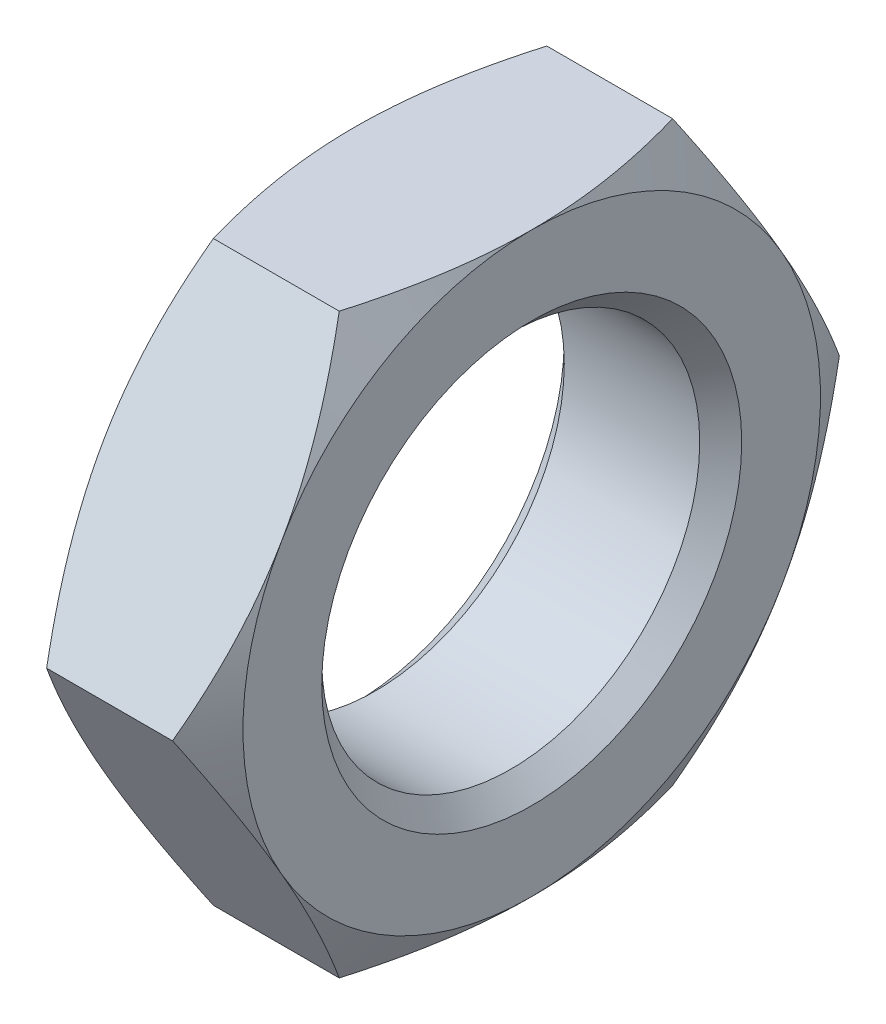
from build123d import *

# Parameters (mm, degrees)
SKETCH1_R      = 18
EXTRUDE1_DEPTH = 16.9
CHAMFER1_SIZE  = 2


with BuildPart() as part:
    # Sketch1 → Extrude1 (new body)
    with BuildSketch(Plane(origin=(0, 0, 0), x_dir=(0, 0, -1), z_dir=(1, 0, 0))):
        Polygon((15.877132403, 27.5), (-15.877132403, 27.5), (-31.754264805, 0), (-15.877132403, -27.5), (15.877132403, -27.5), (31.754264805, 0), align=None)
        Circle(SKETCH1_R, mode=Mode.SUBTRACT)
    extrude(amount=EXTRUDE1_DEPTH)

    # Sketch2 → Cut-Revolve1 (revolve, cut)
    with BuildSketch(Plane.XY):
        Polygon((16.9, 27.5), (16.9, 110), (0, 110), (0, 27.5), (8.45, 42.135829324), align=None)
    revolve(axis=Axis((16.9, 0, 0), (-1, 0, 0)), mode=Mode.SUBTRACT)

    # Chamfer1
    chamfer1_edges = [part.edges().sort_by_distance(p)[0] for p in [
        (0, 0, 18),
        (16.9, 0, 18),
    ]]
    chamfer(chamfer1_edges, length=CHAMFER1_SIZE)


solid = part.part
